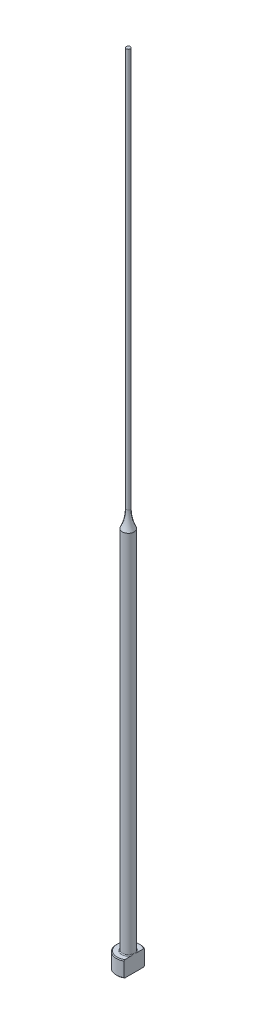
ISO-10303-21;
HEADER;
FILE_DESCRIPTION(('STEP AP214'),'2;1');
FILE_NAME('part.step','',(''),(''),'','','');
FILE_SCHEMA(('AUTOMOTIVE_DESIGN { 1 0 10303 214 1 1 1 1 }'));
ENDSEC;
DATA;
#1=APPLICATION_CONTEXT('core data for automotive mechanical design processes');
#2=APPLICATION_PROTOCOL_DEFINITION('international standard','automotive_design',2000,#1);
#3=PRODUCT_CONTEXT('',#1,'mechanical');
#4=PRODUCT('Part','Part','',(#3));
#5=PRODUCT_RELATED_PRODUCT_CATEGORY('part','',(#4));
#6=PRODUCT_DEFINITION_FORMATION('','',#4);
#7=PRODUCT_DEFINITION_CONTEXT('part definition',#1,'design');
#8=PRODUCT_DEFINITION('design','',#6,#7);
#9=PRODUCT_DEFINITION_SHAPE('','',#8);
#10=(LENGTH_UNIT() NAMED_UNIT(*) SI_UNIT(.MILLI.,.METRE.));
#11=(NAMED_UNIT(*) PLANE_ANGLE_UNIT() SI_UNIT($,.RADIAN.));
#12=(NAMED_UNIT(*) SI_UNIT($,.STERADIAN.) SOLID_ANGLE_UNIT());
#13=UNCERTAINTY_MEASURE_WITH_UNIT(LENGTH_MEASURE(1.E-05),#10,'distance_accuracy_value','');
#14=(GEOMETRIC_REPRESENTATION_CONTEXT(3) GLOBAL_UNCERTAINTY_ASSIGNED_CONTEXT((#13)) GLOBAL_UNIT_ASSIGNED_CONTEXT((#10,
#11,#12)) REPRESENTATION_CONTEXT('',''));
#15=CARTESIAN_POINT('',(0.,0.,0.));
#16=DIRECTION('',(0.,0.,1.));
#17=DIRECTION('',(1.,0.,0.));
#18=AXIS2_PLACEMENT_3D('',#15,#16,#17);
#19=CARTESIAN_POINT('',(-2.99999999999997,4.,0.));
#20=DIRECTION('',(0.,1.,0.));
#21=DIRECTION('',(0.,0.,1.));
#22=AXIS2_PLACEMENT_3D('',#19,#20,#21);
#23=PLANE('',#22);
#24=CARTESIAN_POINT('',(0.,4.,0.));
#25=DIRECTION('',(0.,1.,0.));
#26=DIRECTION('',(0.,0.,1.));
#27=AXIS2_PLACEMENT_3D('',#24,#25,#26);
#28=CIRCLE('',#27,2.79999999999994);
#29=CARTESIAN_POINT('',(1.49999999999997,4.,-2.36431808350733));
#30=VERTEX_POINT('',#29);
#31=CARTESIAN_POINT('',(1.49999999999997,4.,2.36431808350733));
#32=VERTEX_POINT('',#31);
#33=EDGE_CURVE('E187',#30,#32,#28,.T.);
#34=ORIENTED_EDGE('',*,*,#33,.T.);
#35=DIRECTION('',(0.,0.,-1.));
#36=VECTOR('',#35,1.);
#37=CARTESIAN_POINT('',(1.49999999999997,4.,0.));
#38=LINE('',#37,#36);
#39=CARTESIAN_POINT('',(1.49999999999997,3.99999999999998,0.799999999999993));
#40=VERTEX_POINT('',#39);
#41=EDGE_CURVE('E57',#32,#40,#38,.T.);
#42=ORIENTED_EDGE('',*,*,#41,.T.);
#43=CARTESIAN_POINT('',(0.,4.,0.));
#44=DIRECTION('',(0.,1.,0.));
#45=DIRECTION('',(0.,0.,1.));
#46=AXIS2_PLACEMENT_3D('',#43,#44,#45);
#47=CIRCLE('',#46,1.69999999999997);
#48=CARTESIAN_POINT('',(1.49999999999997,3.99999999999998,-0.799999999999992));
#49=VERTEX_POINT('',#48);
#50=EDGE_CURVE('E108',#40,#49,#47,.F.);
#51=ORIENTED_EDGE('',*,*,#50,.T.);
#52=EDGE_CURVE('E137',#49,#30,#38,.T.);
#53=ORIENTED_EDGE('',*,*,#52,.T.);
#54=EDGE_LOOP('',(#34,#42,#51,#53));
#55=FACE_BOUND('',#54,.T.);
#56=ADVANCED_FACE('F32',(#55),#23,.T.);
#57=CARTESIAN_POINT('',(0.,259.958771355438,0.));
#58=DIRECTION('',(0.,1.,0.));
#59=DIRECTION('',(0.,0.,1.));
#60=AXIS2_PLACEMENT_3D('',#57,#58,#59);
#61=CYLINDRICAL_SURFACE('',#60,2.99999999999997);
#62=CARTESIAN_POINT('',(0.,3.79999999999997,0.));
#63=DIRECTION('',(0.,1.,0.));
#64=DIRECTION('',(0.,0.,1.));
#65=AXIS2_PLACEMENT_3D('',#62,#63,#64);
#66=CIRCLE('',#65,2.99999999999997);
#67=CARTESIAN_POINT('',(1.49999999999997,3.79999999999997,2.5980762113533));
#68=VERTEX_POINT('',#67);
#69=CARTESIAN_POINT('',(1.49999999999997,3.79999999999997,-2.5980762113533));
#70=VERTEX_POINT('',#69);
#71=EDGE_CURVE('E105',#68,#70,#66,.F.);
#72=ORIENTED_EDGE('',*,*,#71,.T.);
#73=DIRECTION('',(0.,-1.,0.));
#74=VECTOR('',#73,1.);
#75=CARTESIAN_POINT('',(1.49999999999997,200.,-2.5980762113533));
#76=LINE('',#75,#74);
#77=CARTESIAN_POINT('',(1.49999999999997,0.200000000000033,-2.5980762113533));
#78=VERTEX_POINT('',#77);
#79=EDGE_CURVE('E193',#70,#78,#76,.T.);
#80=ORIENTED_EDGE('',*,*,#79,.T.);
#81=CARTESIAN_POINT('',(0.,0.200000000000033,0.));
#82=DIRECTION('',(0.,-1.,0.));
#83=DIRECTION('',(0.,0.,-1.));
#84=AXIS2_PLACEMENT_3D('',#81,#82,#83);
#85=CIRCLE('',#84,2.99999999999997);
#86=CARTESIAN_POINT('',(1.49999999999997,0.200000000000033,2.5980762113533));
#87=VERTEX_POINT('',#86);
#88=EDGE_CURVE('E100',#78,#87,#85,.F.);
#89=ORIENTED_EDGE('',*,*,#88,.T.);
#90=DIRECTION('',(0.,-1.,0.));
#91=VECTOR('',#90,1.);
#92=CARTESIAN_POINT('',(1.49999999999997,200.,2.5980762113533));
#93=LINE('',#92,#91);
#94=EDGE_CURVE('E93',#68,#87,#93,.T.);
#95=ORIENTED_EDGE('',*,*,#94,.F.);
#96=EDGE_LOOP('',(#72,#80,#89,#95));
#97=FACE_BOUND('',#96,.T.);
#98=ADVANCED_FACE('F158',(#97),#61,.T.);
#99=CARTESIAN_POINT('',(0.,0.,0.));
#100=DIRECTION('',(0.,-1.,0.));
#101=DIRECTION('',(0.,0.,-1.));
#102=AXIS2_PLACEMENT_3D('',#99,#100,#101);
#103=PLANE('',#102);
#104=CARTESIAN_POINT('',(0.,0.,0.));
#105=DIRECTION('',(0.,-1.,0.));
#106=DIRECTION('',(0.,0.,-1.));
#107=AXIS2_PLACEMENT_3D('',#104,#105,#106);
#108=CIRCLE('',#107,2.79999999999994);
#109=CARTESIAN_POINT('',(1.49999999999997,0.,2.36431808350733));
#110=VERTEX_POINT('',#109);
#111=CARTESIAN_POINT('',(1.49999999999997,0.,-2.36431808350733));
#112=VERTEX_POINT('',#111);
#113=EDGE_CURVE('E98',#110,#112,#108,.T.);
#114=ORIENTED_EDGE('',*,*,#113,.T.);
#115=DIRECTION('',(0.,0.,1.));
#116=VECTOR('',#115,1.);
#117=CARTESIAN_POINT('',(1.49999999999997,0.,2.5980762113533));
#118=LINE('',#117,#116);
#119=EDGE_CURVE('E83',#112,#110,#118,.T.);
#120=ORIENTED_EDGE('',*,*,#119,.T.);
#121=EDGE_LOOP('',(#114,#120));
#122=FACE_BOUND('',#121,.T.);
#123=ADVANCED_FACE('F103',(#122),#103,.T.);
#124=CARTESIAN_POINT('',(0.,4.,0.));
#125=DIRECTION('',(0.,-1.,0.));
#126=DIRECTION('',(0.,0.,-1.));
#127=AXIS2_PLACEMENT_3D('',#124,#125,#126);
#128=CONICAL_SURFACE('',#127,2.79999999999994,0.785398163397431);
#129=ORIENTED_EDGE('',*,*,#71,.F.);
#130=CARTESIAN_POINT('',(1.49999999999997,0.888258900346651,5.71827621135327));
#131=CARTESIAN_POINT('',(1.49999999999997,1.01361833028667,5.58866816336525));
#132=CARTESIAN_POINT('',(1.49999999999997,1.13884324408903,5.45892957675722));
#133=CARTESIAN_POINT('',(1.49999999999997,1.38894444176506,5.19911365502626));
#134=CARTESIAN_POINT('',(1.49999999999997,1.51382072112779,5.06903631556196));
#135=CARTESIAN_POINT('',(1.49999999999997,1.76320568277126,4.80840180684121));
#136=CARTESIAN_POINT('',(1.49999999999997,1.88771414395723,4.67784442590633));
#137=CARTESIAN_POINT('',(1.49999999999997,2.13618059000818,4.4162081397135));
#138=CARTESIAN_POINT('',(1.49999999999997,2.26013857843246,4.28512923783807));
#139=CARTESIAN_POINT('',(1.49999999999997,2.50488975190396,4.02490837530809));
#140=CARTESIAN_POINT('',(1.49999999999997,2.62569693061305,3.8957795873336));
#141=CARTESIAN_POINT('',(1.49999999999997,2.86640694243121,3.63668213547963));
#142=CARTESIAN_POINT('',(1.49999999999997,2.98630978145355,3.50671347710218));
#143=CARTESIAN_POINT('',(1.49999999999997,3.22486033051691,3.24567921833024));
#144=CARTESIAN_POINT('',(1.49999999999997,3.3435083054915,3.11461386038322));
#145=CARTESIAN_POINT('',(1.49999999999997,3.5790771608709,2.85094268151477));
#146=CARTESIAN_POINT('',(1.49999999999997,3.69599811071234,2.71833692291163));
#147=CARTESIAN_POINT('',(1.49999999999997,3.88262371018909,2.50255231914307));
#148=CARTESIAN_POINT('',(1.49999999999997,3.95312454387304,2.42006293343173));
#149=CARTESIAN_POINT('',(1.49999999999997,4.09287098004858,2.254010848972));
#150=CARTESIAN_POINT('',(1.49999999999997,4.16211645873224,2.17044804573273));
#151=CARTESIAN_POINT('',(1.49999999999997,4.29964684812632,2.00105967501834));
#152=CARTESIAN_POINT('',(1.49999999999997,4.36791386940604,1.9152195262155));
#153=CARTESIAN_POINT('',(1.49999999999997,4.50205840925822,1.7417139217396));
#154=CARTESIAN_POINT('',(1.49999999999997,4.56793649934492,1.65404891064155));
#155=CARTESIAN_POINT('',(1.49999999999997,4.69728151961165,1.47490236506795));
#156=CARTESIAN_POINT('',(1.49999999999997,4.76069661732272,1.38338308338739));
#157=CARTESIAN_POINT('',(1.49999999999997,4.88239539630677,1.19675661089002));
#158=CARTESIAN_POINT('',(1.49999999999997,4.94067201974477,1.10164473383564));
#159=CARTESIAN_POINT('',(1.49999999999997,5.048413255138,0.908008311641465));
#160=CARTESIAN_POINT('',(1.49999999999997,5.09797809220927,0.809540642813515));
#161=CARTESIAN_POINT('',(1.49999999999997,5.18432188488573,0.607192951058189));
#162=CARTESIAN_POINT('',(1.49999999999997,5.22114374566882,0.50333247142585));
#163=CARTESIAN_POINT('',(1.49999999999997,5.26099935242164,0.347577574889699));
#164=CARTESIAN_POINT('',(1.49999999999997,5.2715702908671,0.297609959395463));
#165=CARTESIAN_POINT('',(1.49999999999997,5.28794860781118,0.196885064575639));
#166=CARTESIAN_POINT('',(1.49999999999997,5.29375640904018,0.146127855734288));
#167=CARTESIAN_POINT('',(1.49999999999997,5.30019707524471,0.0444388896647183));
#168=CARTESIAN_POINT('',(1.49999999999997,5.30084594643,-0.00649183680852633));
#169=CARTESIAN_POINT('',(1.49999999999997,5.29696416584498,-0.108155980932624));
#170=CARTESIAN_POINT('',(1.49999999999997,5.29243308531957,-0.158889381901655));
#171=CARTESIAN_POINT('',(1.49999999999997,5.27856915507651,-0.259234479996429));
#172=CARTESIAN_POINT('',(1.49999999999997,5.2692782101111,-0.308852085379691));
#173=CARTESIAN_POINT('',(1.49999999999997,5.24647108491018,-0.407110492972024));
#174=CARTESIAN_POINT('',(1.49999999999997,5.23295324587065,-0.45575090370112));
#175=CARTESIAN_POINT('',(1.49999999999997,5.20226175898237,-0.55214996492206));
#176=CARTESIAN_POINT('',(1.49999999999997,5.18506801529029,-0.599902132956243));
#177=CARTESIAN_POINT('',(1.49999999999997,5.1477138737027,-0.694205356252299));
#178=CARTESIAN_POINT('',(1.49999999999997,5.12755408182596,-0.740756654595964));
#179=CARTESIAN_POINT('',(1.49999999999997,5.0632769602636,-0.879166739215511));
#180=CARTESIAN_POINT('',(1.49999999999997,5.01551721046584,-0.969329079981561));
#181=CARTESIAN_POINT('',(1.49999999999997,4.91367909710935,-1.14604316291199));
#182=CARTESIAN_POINT('',(1.49999999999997,4.85959300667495,-1.2325903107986));
#183=CARTESIAN_POINT('',(1.49999999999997,4.74697968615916,-1.40321348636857));
#184=CARTESIAN_POINT('',(1.49999999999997,4.68843573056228,-1.4872783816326));
#185=CARTESIAN_POINT('',(1.49999999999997,4.5684384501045,-1.65322187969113));
#186=CARTESIAN_POINT('',(1.49999999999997,4.50698656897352,-1.73510153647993));
#187=CARTESIAN_POINT('',(1.49999999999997,4.3811567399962,-1.89829823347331));
#188=CARTESIAN_POINT('',(1.49999999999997,4.31675092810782,-1.97959369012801));
#189=CARTESIAN_POINT('',(1.49999999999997,4.18634068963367,-2.14090082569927));
#190=CARTESIAN_POINT('',(1.49999999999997,4.12033609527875,-2.22091236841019));
#191=CARTESIAN_POINT('',(1.49999999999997,3.92086431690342,-2.45906508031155));
#192=CARTESIAN_POINT('',(1.49999999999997,3.78562663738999,-2.61572090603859));
#193=CARTESIAN_POINT('',(1.49999999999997,3.53554498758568,-2.90006295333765));
#194=CARTESIAN_POINT('',(1.49999999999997,3.42114543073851,-3.02814382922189));
#195=CARTESIAN_POINT('',(1.49999999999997,3.1909355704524,-3.28303767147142));
#196=CARTESIAN_POINT('',(1.49999999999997,3.07512522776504,-3.40985060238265));
#197=CARTESIAN_POINT('',(1.49999999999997,2.72597067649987,-3.78913849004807));
#198=CARTESIAN_POINT('',(1.49999999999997,2.49111760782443,-4.04022177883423));
#199=CARTESIAN_POINT('',(1.49999999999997,2.0288247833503,-4.52992803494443));
#200=CARTESIAN_POINT('',(1.49999999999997,1.80147747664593,-4.7686387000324));
#201=CARTESIAN_POINT('',(1.49999999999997,1.45954865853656,-5.12558036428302));
#202=CARTESIAN_POINT('',(1.49999999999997,1.34548484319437,-5.24430773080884));
#203=CARTESIAN_POINT('',(1.49999999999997,1.11707176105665,-5.48148573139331));
#204=CARTESIAN_POINT('',(1.49999999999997,1.00272249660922,-5.59993636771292));
#205=CARTESIAN_POINT('',(1.49999999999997,0.888258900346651,-5.71827621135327));
#206=B_SPLINE_CURVE_WITH_KNOTS('',3,(#130,#131,#132,#133,#134,#135,#136,#137,#138,#139,#140,
#141,#142,#143,#144,#145,#146,#147,#148,#149,#150,#151,#152,#153,#154,#155,#156,#157,#158,#159,
#160,#161,#162,#163,#164,#165,#166,#167,#168,#169,#170,#171,#172,#173,#174,#175,#176,#177,#178,
#179,#180,#181,#182,#183,#184,#185,#186,#187,#188,#189,#190,#191,#192,#193,#194,#195,#196,#197,
#198,#199,#200,#201,#202,#203,#204,#205),.UNSPECIFIED.,.F.,.F.,(4,2,2,2,2,2,2,2,2,2,2,2,2,2,2,2,
2,2,2,2,2,2,2,2,2,2,2,2,2,2,2,2,2,2,2,2,2,4),(0.,0.540943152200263,1.08189327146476,
1.62312052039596,2.16434426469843,2.69482920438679,3.22531067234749,3.75567781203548,
4.28602356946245,4.611550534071,4.9371094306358,5.26610945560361,5.59503024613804,
5.92894782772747,6.26331713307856,6.59354403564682,6.92264800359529,7.07567478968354,
7.22868799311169,7.38122626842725,7.53377717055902,7.68500755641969,7.83629736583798,
7.988436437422,8.14054446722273,8.44618799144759,8.75220879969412,9.05944044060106,
9.36652111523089,9.6776428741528,9.98879742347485,10.609592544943,11.1247803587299,
11.6399825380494,12.6713544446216,13.6603005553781,14.1542238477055,14.6481430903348),.UNSPECIFIED.);
#207=EDGE_CURVE('E136',#68,#32,#206,.T.);
#208=ORIENTED_EDGE('',*,*,#207,.T.);
#209=ORIENTED_EDGE('',*,*,#33,.F.);
#210=EDGE_CURVE('E128',#30,#70,#206,.T.);
#211=ORIENTED_EDGE('',*,*,#210,.T.);
#212=EDGE_LOOP('',(#129,#208,#209,#211));
#213=FACE_BOUND('',#212,.T.);
#214=ADVANCED_FACE('F144',(#213),#128,.T.);
#215=CARTESIAN_POINT('',(0.,0.200000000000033,0.));
#216=DIRECTION('',(0.,1.,0.));
#217=DIRECTION('',(0.,0.,1.));
#218=AXIS2_PLACEMENT_3D('',#215,#216,#217);
#219=CONICAL_SURFACE('',#218,2.99999999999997,0.785398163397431);
#220=ORIENTED_EDGE('',*,*,#88,.F.);
#221=CARTESIAN_POINT('',(1.49999999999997,3.11174109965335,-5.71827621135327));
#222=CARTESIAN_POINT('',(1.49999999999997,2.98638166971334,-5.58866816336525));
#223=CARTESIAN_POINT('',(1.49999999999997,2.86115675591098,-5.45892957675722));
#224=CARTESIAN_POINT('',(1.49999999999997,2.61105555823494,-5.19911365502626));
#225=CARTESIAN_POINT('',(1.49999999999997,2.48617927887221,-5.06903631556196));
#226=CARTESIAN_POINT('',(1.49999999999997,2.23679431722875,-4.80840180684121));
#227=CARTESIAN_POINT('',(1.49999999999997,2.11228585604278,-4.67784442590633));
#228=CARTESIAN_POINT('',(1.49999999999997,1.86381940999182,-4.4162081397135));
#229=CARTESIAN_POINT('',(1.49999999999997,1.73986142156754,-4.28512923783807));
#230=CARTESIAN_POINT('',(1.49999999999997,1.49511024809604,-4.02490837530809));
#231=CARTESIAN_POINT('',(1.49999999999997,1.37430306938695,-3.8957795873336));
#232=CARTESIAN_POINT('',(1.49999999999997,1.13359305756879,-3.63668213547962));
#233=CARTESIAN_POINT('',(1.49999999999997,1.01369021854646,-3.50671347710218));
#234=CARTESIAN_POINT('',(1.49999999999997,0.775139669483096,-3.24567921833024));
#235=CARTESIAN_POINT('',(1.49999999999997,0.656491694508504,-3.11461386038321));
#236=CARTESIAN_POINT('',(1.49999999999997,0.420922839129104,-2.85094268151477));
#237=CARTESIAN_POINT('',(1.49999999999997,0.304001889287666,-2.71833692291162));
#238=CARTESIAN_POINT('',(1.49999999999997,0.117376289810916,-2.50255231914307));
#239=CARTESIAN_POINT('',(1.49999999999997,0.0468754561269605,-2.42006293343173));
#240=CARTESIAN_POINT('',(1.49999999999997,-0.0928709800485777,-2.254010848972));
#241=CARTESIAN_POINT('',(1.49999999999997,-0.162116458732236,-2.17044804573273));
#242=CARTESIAN_POINT('',(1.49999999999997,-0.299646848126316,-2.00105967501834));
#243=CARTESIAN_POINT('',(1.49999999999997,-0.367913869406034,-1.9152195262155));
#244=CARTESIAN_POINT('',(1.49999999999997,-0.502058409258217,-1.7417139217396));
#245=CARTESIAN_POINT('',(1.49999999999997,-0.567936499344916,-1.65404891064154));
#246=CARTESIAN_POINT('',(1.49999999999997,-0.697281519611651,-1.47490236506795));
#247=CARTESIAN_POINT('',(1.49999999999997,-0.760696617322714,-1.38338308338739));
#248=CARTESIAN_POINT('',(1.49999999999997,-0.882395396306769,-1.19675661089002));
#249=CARTESIAN_POINT('',(1.49999999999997,-0.940672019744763,-1.10164473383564));
#250=CARTESIAN_POINT('',(1.49999999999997,-1.048413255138,-0.908008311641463));
#251=CARTESIAN_POINT('',(1.49999999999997,-1.09797809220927,-0.809540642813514));
#252=CARTESIAN_POINT('',(1.49999999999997,-1.18432188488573,-0.607192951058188));
#253=CARTESIAN_POINT('',(1.49999999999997,-1.22114374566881,-0.503332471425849));
#254=CARTESIAN_POINT('',(1.49999999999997,-1.26099935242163,-0.347577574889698));
#255=CARTESIAN_POINT('',(1.49999999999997,-1.2715702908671,-0.297609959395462));
#256=CARTESIAN_POINT('',(1.49999999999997,-1.28794860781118,-0.196885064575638));
#257=CARTESIAN_POINT('',(1.49999999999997,-1.29375640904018,-0.146127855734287));
#258=CARTESIAN_POINT('',(1.49999999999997,-1.30019707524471,-0.0444388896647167));
#259=CARTESIAN_POINT('',(1.49999999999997,-1.30084594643,0.00649183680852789));
#260=CARTESIAN_POINT('',(1.49999999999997,-1.29696416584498,0.108155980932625));
#261=CARTESIAN_POINT('',(1.49999999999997,-1.29243308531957,0.158889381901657));
#262=CARTESIAN_POINT('',(1.49999999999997,-1.2785691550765,0.259234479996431));
#263=CARTESIAN_POINT('',(1.49999999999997,-1.2692782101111,0.308852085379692));
#264=CARTESIAN_POINT('',(1.49999999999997,-1.24647108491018,0.407110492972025));
#265=CARTESIAN_POINT('',(1.49999999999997,-1.23295324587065,0.455750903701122));
#266=CARTESIAN_POINT('',(1.49999999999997,-1.20226175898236,0.552149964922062));
#267=CARTESIAN_POINT('',(1.49999999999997,-1.18506801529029,0.599902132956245));
#268=CARTESIAN_POINT('',(1.49999999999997,-1.14771387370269,0.694205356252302));
#269=CARTESIAN_POINT('',(1.49999999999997,-1.12755408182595,0.740756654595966));
#270=CARTESIAN_POINT('',(1.49999999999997,-1.0632769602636,0.879166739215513));
#271=CARTESIAN_POINT('',(1.49999999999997,-1.01551721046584,0.969329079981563));
#272=CARTESIAN_POINT('',(1.49999999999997,-0.913679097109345,1.14604316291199));
#273=CARTESIAN_POINT('',(1.49999999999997,-0.859593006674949,1.2325903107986));
#274=CARTESIAN_POINT('',(1.49999999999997,-0.746979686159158,1.40321348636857));
#275=CARTESIAN_POINT('',(1.49999999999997,-0.688435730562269,1.4872783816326));
#276=CARTESIAN_POINT('',(1.49999999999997,-0.568438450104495,1.65322187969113));
#277=CARTESIAN_POINT('',(1.49999999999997,-0.506986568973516,1.73510153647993));
#278=CARTESIAN_POINT('',(1.49999999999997,-0.381156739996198,1.89829823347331));
#279=CARTESIAN_POINT('',(1.49999999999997,-0.316750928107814,1.97959369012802));
#280=CARTESIAN_POINT('',(1.49999999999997,-0.186340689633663,2.14090082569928));
#281=CARTESIAN_POINT('',(1.49999999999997,-0.12033609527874,2.22091236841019));
#282=CARTESIAN_POINT('',(1.49999999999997,0.0791356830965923,2.45906508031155));
#283=CARTESIAN_POINT('',(1.49999999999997,0.214373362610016,2.61572090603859));
#284=CARTESIAN_POINT('',(1.49999999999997,0.46445501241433,2.90006295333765));
#285=CARTESIAN_POINT('',(1.49999999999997,0.578854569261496,3.02814382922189));
#286=CARTESIAN_POINT('',(1.49999999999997,0.809064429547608,3.28303767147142));
#287=CARTESIAN_POINT('',(1.49999999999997,0.924874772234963,3.40985060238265));
#288=CARTESIAN_POINT('',(1.49999999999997,1.27402932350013,3.78913849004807));
#289=CARTESIAN_POINT('',(1.49999999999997,1.50888239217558,4.04022177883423));
#290=CARTESIAN_POINT('',(1.49999999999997,1.97117521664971,4.52992803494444));
#291=CARTESIAN_POINT('',(1.49999999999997,2.19852252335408,4.76863870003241));
#292=CARTESIAN_POINT('',(1.49999999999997,2.54045134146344,5.12558036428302));
#293=CARTESIAN_POINT('',(1.49999999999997,2.65451515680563,5.24430773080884));
#294=CARTESIAN_POINT('',(1.49999999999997,2.88292823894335,5.48148573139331));
#295=CARTESIAN_POINT('',(1.49999999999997,2.99727750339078,5.59993636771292));
#296=CARTESIAN_POINT('',(1.49999999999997,3.11174109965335,5.71827621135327));
#297=B_SPLINE_CURVE_WITH_KNOTS('',3,(#221,#222,#223,#224,#225,#226,#227,#228,#229,#230,#231,
#232,#233,#234,#235,#236,#237,#238,#239,#240,#241,#242,#243,#244,#245,#246,#247,#248,#249,#250,
#251,#252,#253,#254,#255,#256,#257,#258,#259,#260,#261,#262,#263,#264,#265,#266,#267,#268,#269,
#270,#271,#272,#273,#274,#275,#276,#277,#278,#279,#280,#281,#282,#283,#284,#285,#286,#287,#288,
#289,#290,#291,#292,#293,#294,#295,#296),.UNSPECIFIED.,.F.,.F.,(4,2,2,2,2,2,2,2,2,2,2,2,2,2,2,2,
2,2,2,2,2,2,2,2,2,2,2,2,2,2,2,2,2,2,2,2,2,4),(0.,0.540943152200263,1.08189327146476,
1.62312052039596,2.16434426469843,2.69482920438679,3.22531067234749,3.75567781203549,
4.28602356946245,4.611550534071,4.9371094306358,5.26610945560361,5.59503024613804,
5.92894782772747,6.26331713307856,6.59354403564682,6.92264800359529,7.07567478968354,
7.2286879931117,7.38122626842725,7.53377717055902,7.6850075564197,7.83629736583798,
7.98843643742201,8.14054446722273,8.44618799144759,8.75220879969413,9.05944044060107,
9.3665211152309,9.6776428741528,9.98879742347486,10.609592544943,11.1247803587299,
11.6399825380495,12.6713544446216,13.6603005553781,14.1542238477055,14.6481430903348),.UNSPECIFIED.);
#298=EDGE_CURVE('E86',#78,#112,#297,.T.);
#299=ORIENTED_EDGE('',*,*,#298,.T.);
#300=ORIENTED_EDGE('',*,*,#113,.F.);
#301=EDGE_CURVE('E89',#110,#87,#297,.T.);
#302=ORIENTED_EDGE('',*,*,#301,.T.);
#303=EDGE_LOOP('',(#220,#299,#300,#302));
#304=FACE_BOUND('',#303,.T.);
#305=ADVANCED_FACE('F97',(#304),#219,.T.);
#306=CARTESIAN_POINT('',(0.,4.19999999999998,0.));
#307=DIRECTION('',(0.,1.,0.));
#308=DIRECTION('',(0.,0.,1.));
#309=AXIS2_PLACEMENT_3D('',#306,#307,#308);
#310=TOROIDAL_SURFACE('',#309,1.69999999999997,0.2);
#311=CARTESIAN_POINT('',(1.49999999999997,4.19999999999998,0.));
#312=CARTESIAN_POINT('',(1.49999999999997,4.20000050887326,7.14686674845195E-11));
#313=CARTESIAN_POINT('',(1.49999999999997,4.20000101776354,-1.21663673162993E-07));
#314=CARTESIAN_POINT('',(1.49999999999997,4.20000199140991,-4.97616237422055E-07));
#315=CARTESIAN_POINT('',(1.49999999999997,4.20000245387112,-7.56516220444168E-07));
#316=CARTESIAN_POINT('',(1.49999999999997,4.20000338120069,-1.37642837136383E-06));
#317=CARTESIAN_POINT('',(1.49999999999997,4.20000384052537,-1.74563476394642E-06));
#318=CARTESIAN_POINT('',(1.49999999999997,4.20000469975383,-2.53565984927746E-06));
#319=CARTESIAN_POINT('',(1.49999999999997,4.20000510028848,-2.95582597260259E-06));
#320=CARTESIAN_POINT('',(1.49999999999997,4.20000646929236,-4.48430445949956E-06));
#321=CARTESIAN_POINT('',(1.49999999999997,4.20000736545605,-5.6586103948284E-06));
#322=CARTESIAN_POINT('',(1.49999999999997,4.20000893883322,-8.06479202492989E-06));
#323=CARTESIAN_POINT('',(1.49999999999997,4.20000962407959,-9.29170517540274E-06));
#324=CARTESIAN_POINT('',(1.49999999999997,4.20001225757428,-1.416232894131E-05));
#325=CARTESIAN_POINT('',(1.49999999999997,4.20001407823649,-1.78790031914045E-05));
#326=CARTESIAN_POINT('',(1.49999999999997,4.20001699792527,-2.51443066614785E-05));
#327=CARTESIAN_POINT('',(1.49999999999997,4.20001815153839,-2.86715394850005E-05));
#328=CARTESIAN_POINT('',(1.49999999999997,4.20002315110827,-4.39218128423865E-05));
#329=CARTESIAN_POINT('',(1.49999999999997,4.20002701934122,-5.56288390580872E-05));
#330=CARTESIAN_POINT('',(1.49999999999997,4.20003312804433,-7.7405829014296E-05));
#331=CARTESIAN_POINT('',(1.49999999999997,4.20003553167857,-8.74278412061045E-05));
#332=CARTESIAN_POINT('',(1.49999999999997,4.20005483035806,-0.000161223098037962));
#333=CARTESIAN_POINT('',(1.49999999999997,4.20007979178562,-0.000222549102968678));
#334=CARTESIAN_POINT('',(1.49999999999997,4.20017391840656,-0.000462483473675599));
#335=CARTESIAN_POINT('',(1.49999999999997,4.20023706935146,-0.000642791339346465));
#336=CARTESIAN_POINT('',(1.49999999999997,4.20048761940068,-0.00134785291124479));
#337=CARTESIAN_POINT('',(1.49999999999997,4.20068132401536,-0.00187087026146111));
#338=CARTESIAN_POINT('',(1.49999999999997,4.20147357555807,-0.00402004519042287));
#339=CARTESIAN_POINT('',(1.49999999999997,4.20206499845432,-0.0056481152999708));
#340=CARTESIAN_POINT('',(1.49999999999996,4.20892634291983,-0.0245232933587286));
#341=CARTESIAN_POINT('',(1.49999999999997,4.21523683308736,-0.041759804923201));
#342=CARTESIAN_POINT('',(1.49999999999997,4.22755028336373,-0.0756091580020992));
#343=CARTESIAN_POINT('',(1.49999999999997,4.23355589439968,-0.0922211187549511));
#344=CARTESIAN_POINT('',(1.49999999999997,4.24620101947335,-0.127454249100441));
#345=CARTESIAN_POINT('',(1.49999999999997,4.25283080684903,-0.146078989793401));
#346=CARTESIAN_POINT('',(1.49999999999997,4.26599765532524,-0.183577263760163));
#347=CARTESIAN_POINT('',(1.49999999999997,4.27253305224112,-0.202451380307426));
#348=CARTESIAN_POINT('',(1.49999999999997,4.28834228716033,-0.248982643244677));
#349=CARTESIAN_POINT('',(1.49999999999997,4.2974915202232,-0.276682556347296));
#350=CARTESIAN_POINT('',(1.49999999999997,4.31490935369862,-0.331625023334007));
#351=CARTESIAN_POINT('',(1.49999999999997,4.3231938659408,-0.358862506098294));
#352=CARTESIAN_POINT('',(1.49999999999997,4.34051594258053,-0.419125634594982));
#353=CARTESIAN_POINT('',(1.49999999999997,4.34936607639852,-0.452206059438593));
#354=CARTESIAN_POINT('',(1.49999999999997,4.36549583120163,-0.519023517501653));
#355=CARTESIAN_POINT('',(1.49999999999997,4.37276283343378,-0.552763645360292));
#356=CARTESIAN_POINT('',(1.49999999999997,4.38554755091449,-0.62305310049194));
#357=CARTESIAN_POINT('',(1.49999999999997,4.39090573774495,-0.65963271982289));
#358=CARTESIAN_POINT('',(1.49999999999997,4.39825016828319,-0.733028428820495));
#359=CARTESIAN_POINT('',(1.49999999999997,4.40024734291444,-0.76984335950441));
#360=CARTESIAN_POINT('',(1.49999999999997,4.39970780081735,-0.842856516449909));
#361=CARTESIAN_POINT('',(1.49999999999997,4.39725347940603,-0.879053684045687));
#362=CARTESIAN_POINT('',(1.49999999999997,4.38900085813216,-0.93238076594));
#363=CARTESIAN_POINT('',(1.49999999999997,4.38553049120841,-0.949868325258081));
#364=CARTESIAN_POINT('',(1.49999999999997,4.37678336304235,-0.984374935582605));
#365=CARTESIAN_POINT('',(1.49999999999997,4.37150943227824,-1.00139467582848));
#366=CARTESIAN_POINT('',(1.49999999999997,4.35869781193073,-1.03479423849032));
#367=CARTESIAN_POINT('',(1.49999999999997,4.3511359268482,-1.05116499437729));
#368=CARTESIAN_POINT('',(1.49999999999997,4.33325333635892,-1.08234828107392));
#369=CARTESIAN_POINT('',(1.49999999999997,4.32294266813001,-1.09716621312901));
#370=CARTESIAN_POINT('',(1.49999999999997,4.30512758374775,-1.11714173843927));
#371=CARTESIAN_POINT('',(1.49999999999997,4.29884721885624,-1.12339066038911));
#372=CARTESIAN_POINT('',(1.49999999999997,4.28545950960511,-1.13494695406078));
#373=CARTESIAN_POINT('',(1.49999999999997,4.27835226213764,-1.14025443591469));
#374=CARTESIAN_POINT('',(1.49999999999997,4.26325970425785,-1.14967631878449));
#375=CARTESIAN_POINT('',(1.49999999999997,4.25526534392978,-1.15377649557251));
#376=CARTESIAN_POINT('',(1.49999999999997,4.23863207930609,-1.16034952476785));
#377=CARTESIAN_POINT('',(1.49999999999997,4.22999427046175,-1.16282507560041));
#378=CARTESIAN_POINT('',(1.49999999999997,4.21343922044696,-1.16570267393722));
#379=CARTESIAN_POINT('',(1.49999999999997,4.20555896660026,-1.16631687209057));
#380=CARTESIAN_POINT('',(1.49999999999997,4.18982775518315,-1.16602054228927));
#381=CARTESIAN_POINT('',(1.49999999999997,4.18197679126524,-1.16511036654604));
#382=CARTESIAN_POINT('',(1.49999999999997,4.16747846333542,-1.16204446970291));
#383=CARTESIAN_POINT('',(1.49999999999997,4.16079696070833,-1.16004509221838));
#384=CARTESIAN_POINT('',(1.49999999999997,4.14781700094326,-1.15505972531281));
#385=CARTESIAN_POINT('',(1.49999999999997,4.14151862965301,-1.1520735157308));
#386=CARTESIAN_POINT('',(1.49999999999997,4.12690214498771,-1.14387585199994));
#387=CARTESIAN_POINT('',(1.49999999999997,4.11881436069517,-1.13825400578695));
#388=CARTESIAN_POINT('',(1.49999999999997,4.1036444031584,-1.12578441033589));
#389=CARTESIAN_POINT('',(1.49999999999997,4.09656475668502,-1.11893367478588));
#390=CARTESIAN_POINT('',(1.49999999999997,4.08012297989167,-1.10074342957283));
#391=CARTESIAN_POINT('',(1.49999999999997,4.07136543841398,-1.08886044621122));
#392=CARTESIAN_POINT('',(1.49999999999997,4.05578194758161,-1.06392743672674));
#393=CARTESIAN_POINT('',(1.49999999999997,4.0489571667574,-1.05087671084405));
#394=CARTESIAN_POINT('',(1.49999999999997,4.03273856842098,-1.01472307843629));
#395=CARTESIAN_POINT('',(1.49999999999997,4.02486230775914,-0.990945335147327));
#396=CARTESIAN_POINT('',(1.49999999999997,4.01257693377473,-0.94232199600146));
#397=CARTESIAN_POINT('',(1.49999999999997,4.00820590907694,-0.917467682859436));
#398=CARTESIAN_POINT('',(1.49999999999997,4.00229956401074,-0.867912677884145));
#399=CARTESIAN_POINT('',(1.49999999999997,4.0007128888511,-0.843217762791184));
#400=CARTESIAN_POINT('',(1.49999999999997,3.9996723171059,-0.79374605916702));
#401=CARTESIAN_POINT('',(1.49999999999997,4.0002230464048,-0.768969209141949));
#402=CARTESIAN_POINT('',(1.49999999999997,4.00433101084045,-0.696994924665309));
#403=CARTESIAN_POINT('',(1.49999999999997,4.01016976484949,-0.64993124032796));
#404=CARTESIAN_POINT('',(1.49999999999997,4.02567776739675,-0.559166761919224));
#405=CARTESIAN_POINT('',(1.49999999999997,4.03511950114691,-0.515423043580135));
#406=CARTESIAN_POINT('',(1.49999999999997,4.05693059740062,-0.427590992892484));
#407=CARTESIAN_POINT('',(1.49999999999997,4.06936356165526,-0.383518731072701));
#408=CARTESIAN_POINT('',(1.49999999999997,4.09174953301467,-0.310161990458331));
#409=CARTESIAN_POINT('',(1.49999999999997,4.10119843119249,-0.280718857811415));
#410=CARTESIAN_POINT('',(1.49999999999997,4.12060442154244,-0.22234098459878));
#411=CARTESIAN_POINT('',(1.49999999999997,4.13055519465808,-0.193404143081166));
#412=CARTESIAN_POINT('',(1.49999999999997,4.14973721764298,-0.138756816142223));
#413=CARTESIAN_POINT('',(1.49999999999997,4.15893123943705,-0.113033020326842));
#414=CARTESIAN_POINT('',(1.49999999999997,4.17788037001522,-0.0606351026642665));
#415=CARTESIAN_POINT('',(1.49999999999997,4.18764328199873,-0.0339636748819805));
#416=CARTESIAN_POINT('',(1.49999999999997,4.19793548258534,-0.00564657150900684));
#417=CARTESIAN_POINT('',(1.49999999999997,4.19852751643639,-0.00401699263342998));
#418=CARTESIAN_POINT('',(1.49999999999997,4.1993199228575,-0.0018674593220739));
#419=CARTESIAN_POINT('',(1.49999999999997,4.19951319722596,-0.00134559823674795));
#420=CARTESIAN_POINT('',(1.49999999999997,4.19976322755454,-0.000641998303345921));
#421=CARTESIAN_POINT('',(1.49999999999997,4.19982627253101,-0.000461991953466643));
#422=CARTESIAN_POINT('',(1.49999999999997,4.19992025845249,-0.000222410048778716));
#423=CARTESIAN_POINT('',(1.49999999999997,4.19994519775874,-0.000161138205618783));
#424=CARTESIAN_POINT('',(1.49999999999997,4.19996448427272,-8.74039267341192E-05));
#425=CARTESIAN_POINT('',(1.49999999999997,4.19996688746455,-7.73857556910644E-05));
#426=CARTESIAN_POINT('',(1.49999999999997,4.1999729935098,-5.56173272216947E-05));
#427=CARTESIAN_POINT('',(1.49999999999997,4.19997685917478,-4.39149186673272E-05));
#428=CARTESIAN_POINT('',(1.49999999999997,4.19998185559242,-2.86698156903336E-05));
#429=CARTESIAN_POINT('',(1.49999999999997,4.19998300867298,-2.51431575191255E-05));
#430=CARTESIAN_POINT('',(1.49999999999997,4.19998592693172,-1.78789552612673E-05));
#431=CARTESIAN_POINT('',(1.49999999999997,4.19998774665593,-1.41627846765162E-05));
#432=CARTESIAN_POINT('',(1.49999999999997,4.19999037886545,-9.29264488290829E-06));
#433=CARTESIAN_POINT('',(1.49999999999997,4.19999106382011,-8.06577599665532E-06));
#434=CARTESIAN_POINT('',(1.49999999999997,4.19999263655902,-5.65962639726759E-06));
#435=CARTESIAN_POINT('',(1.49999999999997,4.19999353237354,-4.48530466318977E-06));
#436=CARTESIAN_POINT('',(1.49999999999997,4.19999490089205,-2.95673740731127E-06));
#437=CARTESIAN_POINT('',(1.49999999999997,4.1999953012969,-2.53653208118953E-06));
#438=CARTESIAN_POINT('',(1.49999999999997,4.19999616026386,-1.74640525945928E-06));
#439=CARTESIAN_POINT('',(1.49999999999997,4.19999661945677,-1.37713598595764E-06));
#440=CARTESIAN_POINT('',(1.49999999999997,4.19999754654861,-7.57072336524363E-07));
#441=CARTESIAN_POINT('',(1.49999999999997,4.19999800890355,-4.9808738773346E-07));
#442=CARTESIAN_POINT('',(1.49999999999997,4.19999898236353,-1.21927249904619E-07));
#443=CARTESIAN_POINT('',(1.49999999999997,4.19999949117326,-7.14621294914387E-11));
#444=CARTESIAN_POINT('',(1.49999999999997,4.19999999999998,0.));
#445=B_SPLINE_CURVE_WITH_KNOTS('',3,(#311,#312,#313,#314,#315,#316,#317,#318,#319,#320,#321,
#322,#323,#324,#325,#326,#327,#328,#329,#330,#331,#332,#333,#334,#335,#336,#337,#338,#339,#340,
#341,#342,#343,#344,#345,#346,#347,#348,#349,#350,#351,#352,#353,#354,#355,#356,#357,#358,#359,
#360,#361,#362,#363,#364,#365,#366,#367,#368,#369,#370,#371,#372,#373,#374,#375,#376,#377,#378,
#379,#380,#381,#382,#383,#384,#385,#386,#387,#388,#389,#390,#391,#392,#393,#394,#395,#396,#397,
#398,#399,#400,#401,#402,#403,#404,#405,#406,#407,#408,#409,#410,#411,#412,#413,#414,#415,#416,
#417,#418,#419,#420,#421,#422,#423,#424,#425,#426,#427,#428,#429,#430,#431,#432,#433,#434,#435,
#436,#437,#438,#439,#440,#441,#442,#443,#444),.UNSPECIFIED.,.T.,.F.,(4,2,2,2,2,2,2,2,2,2,2,2,2,
2,2,2,2,2,2,2,2,2,2,2,2,2,2,2,2,2,2,2,2,2,2,2,2,2,2,2,2,2,2,2,2,2,2,2,2,2,2,2,2,2,2,2,2,2,2,2,2,
2,2,2,2,2,4),(0.,1.5268750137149E-06,3.10959387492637E-06,4.86976756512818E-06,
6.60940084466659E-06,1.10202525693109E-05,1.5232779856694E-05,2.7614037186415E-05,
3.87351645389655E-05,7.57188332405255E-05,0.000106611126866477,0.000304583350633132,
0.00087827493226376,0.00255078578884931,0.0077480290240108,0.0628090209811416,0.115802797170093,
0.175110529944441,0.23503061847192,0.32253950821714,0.407938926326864,0.510638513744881,
0.614128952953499,0.724918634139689,0.835347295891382,0.943752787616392,0.997165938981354,
1.05049564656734,1.10441029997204,1.15813071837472,1.18463966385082,1.21114550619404,
1.23795217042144,1.26471419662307,1.2882832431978,1.31184684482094,1.33268332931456,
1.35352446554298,1.38290826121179,1.41236445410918,1.45639976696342,1.50046164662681,
1.57518788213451,1.65071550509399,1.72483484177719,1.79911468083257,1.94105061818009,
2.07520625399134,2.2125154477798,2.30527614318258,2.39707056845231,2.47902409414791,
2.56422207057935,2.56942417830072,2.57109299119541,2.57166572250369,2.57186352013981,
2.57189440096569,2.57193136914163,2.57194248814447,2.57195486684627,2.57195907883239,
2.57196348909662,2.57196522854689,2.57196698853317,2.57196857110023,2.57197009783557),.UNSPECIFIED.);
#446=CARTESIAN_POINT('',(1.49999999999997,4.19999999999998,0.));
#447=VERTEX_POINT('',#446);
#448=EDGE_CURVE('E11',#49,#447,#445,.T.);
#449=ORIENTED_EDGE('',*,*,#448,.F.);
#450=ORIENTED_EDGE('',*,*,#50,.F.);
#451=CARTESIAN_POINT('',(1.49999999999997,4.19999999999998,0.));
#452=CARTESIAN_POINT('',(1.49999999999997,4.1999994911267,-7.1468641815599E-11));
#453=CARTESIAN_POINT('',(1.49999999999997,4.19999898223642,1.21663673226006E-07));
#454=CARTESIAN_POINT('',(1.49999999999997,4.19999800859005,4.97616237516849E-07));
#455=CARTESIAN_POINT('',(1.49999999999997,4.19999754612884,7.56516220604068E-07));
#456=CARTESIAN_POINT('',(1.49999999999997,4.19999661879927,1.37642837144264E-06));
#457=CARTESIAN_POINT('',(1.49999999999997,4.1999961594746,1.74563476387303E-06));
#458=CARTESIAN_POINT('',(1.49999999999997,4.19999530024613,2.5356598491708E-06));
#459=CARTESIAN_POINT('',(1.49999999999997,4.19999489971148,2.95582597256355E-06));
#460=CARTESIAN_POINT('',(1.49999999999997,4.1999935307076,4.48430445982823E-06));
#461=CARTESIAN_POINT('',(1.49999999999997,4.19999263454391,5.6586103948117E-06));
#462=CARTESIAN_POINT('',(1.49999999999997,4.19999106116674,8.06479202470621E-06));
#463=CARTESIAN_POINT('',(1.49999999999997,4.19999037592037,9.29170517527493E-06));
#464=CARTESIAN_POINT('',(1.49999999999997,4.19998774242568,1.41623289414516E-05));
#465=CARTESIAN_POINT('',(1.49999999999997,4.19998592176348,1.78790031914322E-05));
#466=CARTESIAN_POINT('',(1.49999999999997,4.1999830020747,2.51443066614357E-05));
#467=CARTESIAN_POINT('',(1.49999999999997,4.19998184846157,2.86715394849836E-05));
#468=CARTESIAN_POINT('',(1.49999999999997,4.1999768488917,4.39218128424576E-05));
#469=CARTESIAN_POINT('',(1.49999999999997,4.19997298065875,5.56288390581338E-05));
#470=CARTESIAN_POINT('',(1.49999999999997,4.19996687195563,7.7405829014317E-05));
#471=CARTESIAN_POINT('',(1.49999999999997,4.19996446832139,8.74278412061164E-05));
#472=CARTESIAN_POINT('',(1.49999999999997,4.1999451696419,0.000161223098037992));
#473=CARTESIAN_POINT('',(1.49999999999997,4.19992020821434,0.000222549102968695));
#474=CARTESIAN_POINT('',(1.49999999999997,4.19982608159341,0.000462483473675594));
#475=CARTESIAN_POINT('',(1.49999999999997,4.1997629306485,0.000642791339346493));
#476=CARTESIAN_POINT('',(1.49999999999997,4.19951238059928,0.00134785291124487));
#477=CARTESIAN_POINT('',(1.49999999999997,4.19931867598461,0.00187087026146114));
#478=CARTESIAN_POINT('',(1.49999999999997,4.19852642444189,0.00402004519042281));
#479=CARTESIAN_POINT('',(1.49999999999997,4.19793500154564,0.00564811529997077));
#480=CARTESIAN_POINT('',(1.49999999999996,4.19107365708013,0.0245232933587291));
#481=CARTESIAN_POINT('',(1.49999999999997,4.1847631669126,0.0417598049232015));
#482=CARTESIAN_POINT('',(1.49999999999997,4.17244971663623,0.0756091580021));
#483=CARTESIAN_POINT('',(1.49999999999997,4.16644410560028,0.0922211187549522));
#484=CARTESIAN_POINT('',(1.49999999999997,4.15379898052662,0.127454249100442));
#485=CARTESIAN_POINT('',(1.49999999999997,4.14716919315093,0.146078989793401));
#486=CARTESIAN_POINT('',(1.49999999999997,4.13400234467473,0.183577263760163));
#487=CARTESIAN_POINT('',(1.49999999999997,4.12746694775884,0.202451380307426));
#488=CARTESIAN_POINT('',(1.49999999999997,4.11165771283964,0.248982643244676));
#489=CARTESIAN_POINT('',(1.49999999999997,4.10250847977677,0.276682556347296));
#490=CARTESIAN_POINT('',(1.49999999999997,4.08509064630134,0.331625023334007));
#491=CARTESIAN_POINT('',(1.49999999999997,4.07680613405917,0.358862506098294));
#492=CARTESIAN_POINT('',(1.49999999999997,4.05948405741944,0.419125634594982));
#493=CARTESIAN_POINT('',(1.49999999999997,4.05063392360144,0.452206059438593));
#494=CARTESIAN_POINT('',(1.49999999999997,4.03450416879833,0.519023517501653));
#495=CARTESIAN_POINT('',(1.49999999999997,4.02723716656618,0.552763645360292));
#496=CARTESIAN_POINT('',(1.49999999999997,4.01445244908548,0.62305310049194));
#497=CARTESIAN_POINT('',(1.49999999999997,4.00909426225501,0.659632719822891));
#498=CARTESIAN_POINT('',(1.49999999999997,4.00174983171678,0.733028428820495));
#499=CARTESIAN_POINT('',(1.49999999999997,3.99975265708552,0.76984335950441));
#500=CARTESIAN_POINT('',(1.49999999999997,4.00029219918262,0.842856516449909));
#501=CARTESIAN_POINT('',(1.49999999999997,4.00274652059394,0.879053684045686));
#502=CARTESIAN_POINT('',(1.49999999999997,4.0109991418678,0.93238076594));
#503=CARTESIAN_POINT('',(1.49999999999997,4.01446950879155,0.949868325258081));
#504=CARTESIAN_POINT('',(1.49999999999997,4.02321663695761,0.984374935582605));
#505=CARTESIAN_POINT('',(1.49999999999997,4.02849056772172,1.00139467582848));
#506=CARTESIAN_POINT('',(1.49999999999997,4.04130218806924,1.03479423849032));
#507=CARTESIAN_POINT('',(1.49999999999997,4.04886407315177,1.05116499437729));
#508=CARTESIAN_POINT('',(1.49999999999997,4.06674666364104,1.08234828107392));
#509=CARTESIAN_POINT('',(1.49999999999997,4.07705733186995,1.09716621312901));
#510=CARTESIAN_POINT('',(1.49999999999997,4.09487241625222,1.11714173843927));
#511=CARTESIAN_POINT('',(1.49999999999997,4.10115278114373,1.12339066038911));
#512=CARTESIAN_POINT('',(1.49999999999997,4.11454049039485,1.13494695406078));
#513=CARTESIAN_POINT('',(1.49999999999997,4.12164773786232,1.14025443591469));
#514=CARTESIAN_POINT('',(1.49999999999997,4.13674029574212,1.14967631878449));
#515=CARTESIAN_POINT('',(1.49999999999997,4.14473465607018,1.15377649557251));
#516=CARTESIAN_POINT('',(1.49999999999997,4.16136792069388,1.16034952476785));
#517=CARTESIAN_POINT('',(1.49999999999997,4.17000572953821,1.16282507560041));
#518=CARTESIAN_POINT('',(1.49999999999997,4.186560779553,1.16570267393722));
#519=CARTESIAN_POINT('',(1.49999999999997,4.1944410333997,1.16631687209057));
#520=CARTESIAN_POINT('',(1.49999999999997,4.21017224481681,1.16602054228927));
#521=CARTESIAN_POINT('',(1.49999999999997,4.21802320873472,1.16511036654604));
#522=CARTESIAN_POINT('',(1.49999999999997,4.23252153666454,1.16204446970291));
#523=CARTESIAN_POINT('',(1.49999999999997,4.23920303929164,1.16004509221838));
#524=CARTESIAN_POINT('',(1.49999999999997,4.2521829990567,1.15505972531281));
#525=CARTESIAN_POINT('',(1.49999999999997,4.25848137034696,1.1520735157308));
#526=CARTESIAN_POINT('',(1.49999999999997,4.27309785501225,1.14387585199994));
#527=CARTESIAN_POINT('',(1.49999999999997,4.28118563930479,1.13825400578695));
#528=CARTESIAN_POINT('',(1.49999999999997,4.29635559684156,1.12578441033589));
#529=CARTESIAN_POINT('',(1.49999999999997,4.30343524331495,1.11893367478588));
#530=CARTESIAN_POINT('',(1.49999999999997,4.31987702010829,1.10074342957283));
#531=CARTESIAN_POINT('',(1.49999999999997,4.32863456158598,1.08886044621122));
#532=CARTESIAN_POINT('',(1.49999999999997,4.34421805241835,1.06392743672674));
#533=CARTESIAN_POINT('',(1.49999999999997,4.35104283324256,1.05087671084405));
#534=CARTESIAN_POINT('',(1.49999999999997,4.36726143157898,1.01472307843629));
#535=CARTESIAN_POINT('',(1.49999999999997,4.37513769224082,0.990945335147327));
#536=CARTESIAN_POINT('',(1.49999999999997,4.38742306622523,0.94232199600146));
#537=CARTESIAN_POINT('',(1.49999999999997,4.39179409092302,0.917467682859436));
#538=CARTESIAN_POINT('',(1.49999999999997,4.39770043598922,0.867912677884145));
#539=CARTESIAN_POINT('',(1.49999999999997,4.39928711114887,0.843217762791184));
#540=CARTESIAN_POINT('',(1.49999999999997,4.40032768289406,0.79374605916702));
#541=CARTESIAN_POINT('',(1.49999999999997,4.39977695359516,0.768969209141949));
#542=CARTESIAN_POINT('',(1.49999999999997,4.39566898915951,0.696994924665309));
#543=CARTESIAN_POINT('',(1.49999999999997,4.38983023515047,0.64993124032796));
#544=CARTESIAN_POINT('',(1.49999999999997,4.37432223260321,0.559166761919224));
#545=CARTESIAN_POINT('',(1.49999999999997,4.36488049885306,0.515423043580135));
#546=CARTESIAN_POINT('',(1.49999999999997,4.34306940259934,0.427590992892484));
#547=CARTESIAN_POINT('',(1.49999999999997,4.33063643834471,0.383518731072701));
#548=CARTESIAN_POINT('',(1.49999999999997,4.30825046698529,0.310161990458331));
#549=CARTESIAN_POINT('',(1.49999999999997,4.29880156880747,0.280718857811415));
#550=CARTESIAN_POINT('',(1.49999999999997,4.27939557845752,0.22234098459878));
#551=CARTESIAN_POINT('',(1.49999999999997,4.26944480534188,0.193404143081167));
#552=CARTESIAN_POINT('',(1.49999999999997,4.25026278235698,0.138756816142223));
#553=CARTESIAN_POINT('',(1.49999999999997,4.24106876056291,0.113033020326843));
#554=CARTESIAN_POINT('',(1.49999999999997,4.22211962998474,0.0606351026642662));
#555=CARTESIAN_POINT('',(1.49999999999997,4.21235671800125,0.0339636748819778));
#556=CARTESIAN_POINT('',(1.49999999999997,4.20206451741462,0.00564657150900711));
#557=CARTESIAN_POINT('',(1.49999999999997,4.20147248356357,0.00401699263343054));
#558=CARTESIAN_POINT('',(1.49999999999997,4.20068007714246,0.00186745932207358));
#559=CARTESIAN_POINT('',(1.49999999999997,4.200486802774,0.00134559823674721));
#560=CARTESIAN_POINT('',(1.49999999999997,4.20023677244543,0.000641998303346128));
#561=CARTESIAN_POINT('',(1.49999999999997,4.20017372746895,0.000461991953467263));
#562=CARTESIAN_POINT('',(1.49999999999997,4.20007974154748,0.000222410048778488));
#563=CARTESIAN_POINT('',(1.49999999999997,4.20005480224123,0.000161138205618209));
#564=CARTESIAN_POINT('',(1.49999999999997,4.20003551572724,8.74039267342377E-05));
#565=CARTESIAN_POINT('',(1.49999999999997,4.20003311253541,7.73857556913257E-05));
#566=CARTESIAN_POINT('',(1.49999999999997,4.20002700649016,5.56173272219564E-05));
#567=CARTESIAN_POINT('',(1.49999999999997,4.20002314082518,4.39149186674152E-05));
#568=CARTESIAN_POINT('',(1.49999999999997,4.20001814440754,2.86698156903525E-05));
#569=CARTESIAN_POINT('',(1.49999999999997,4.20001699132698,2.51431575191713E-05));
#570=CARTESIAN_POINT('',(1.49999999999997,4.20001407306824,1.78789552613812E-05));
#571=CARTESIAN_POINT('',(1.49999999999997,4.20001225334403,1.41627846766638E-05));
#572=CARTESIAN_POINT('',(1.49999999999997,4.20000962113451,9.29264488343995E-06));
#573=CARTESIAN_POINT('',(1.49999999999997,4.20000893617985,8.06577599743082E-06));
#574=CARTESIAN_POINT('',(1.49999999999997,4.20000736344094,5.65962639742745E-06));
#575=CARTESIAN_POINT('',(1.49999999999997,4.20000646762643,4.4853046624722E-06));
#576=CARTESIAN_POINT('',(1.49999999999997,4.20000509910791,2.95673740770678E-06));
#577=CARTESIAN_POINT('',(1.49999999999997,4.20000469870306,2.53653208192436E-06));
#578=CARTESIAN_POINT('',(1.49999999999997,4.2000038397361,1.74640526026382E-06));
#579=CARTESIAN_POINT('',(1.49999999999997,4.20000338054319,1.37713598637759E-06));
#580=CARTESIAN_POINT('',(1.49999999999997,4.20000245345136,7.5707233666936E-07));
#581=CARTESIAN_POINT('',(1.49999999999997,4.20000199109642,4.98087387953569E-07));
#582=CARTESIAN_POINT('',(1.49999999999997,4.20000101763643,1.2192725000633E-07));
#583=CARTESIAN_POINT('',(1.49999999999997,4.20000050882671,7.14621038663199E-11));
#584=CARTESIAN_POINT('',(1.49999999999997,4.19999999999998,0.));
#585=B_SPLINE_CURVE_WITH_KNOTS('',3,(#451,#452,#453,#454,#455,#456,#457,#458,#459,#460,#461,
#462,#463,#464,#465,#466,#467,#468,#469,#470,#471,#472,#473,#474,#475,#476,#477,#478,#479,#480,
#481,#482,#483,#484,#485,#486,#487,#488,#489,#490,#491,#492,#493,#494,#495,#496,#497,#498,#499,
#500,#501,#502,#503,#504,#505,#506,#507,#508,#509,#510,#511,#512,#513,#514,#515,#516,#517,#518,
#519,#520,#521,#522,#523,#524,#525,#526,#527,#528,#529,#530,#531,#532,#533,#534,#535,#536,#537,
#538,#539,#540,#541,#542,#543,#544,#545,#546,#547,#548,#549,#550,#551,#552,#553,#554,#555,#556,
#557,#558,#559,#560,#561,#562,#563,#564,#565,#566,#567,#568,#569,#570,#571,#572,#573,#574,#575,
#576,#577,#578,#579,#580,#581,#582,#583,#584),.UNSPECIFIED.,.T.,.F.,(4,2,2,2,2,2,2,2,2,2,2,2,2,
2,2,2,2,2,2,2,2,2,2,2,2,2,2,2,2,2,2,2,2,2,2,2,2,2,2,2,2,2,2,2,2,2,2,2,2,2,2,2,2,2,2,2,2,2,2,2,2,
2,2,2,2,2,4),(0.,1.5268750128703E-06,3.10959387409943E-06,4.86976756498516E-06,
6.60940084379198E-06,1.10202525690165E-05,1.52327798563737E-05,2.76140371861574E-05,
3.87351645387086E-05,7.57188332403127E-05,0.000106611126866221,0.000304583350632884,
0.000878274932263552,0.00255078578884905,0.00774802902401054,0.062809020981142,
0.115802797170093,0.175110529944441,0.235030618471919,0.32253950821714,0.407938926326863,
0.510638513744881,0.614128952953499,0.72491863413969,0.835347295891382,0.943752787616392,
0.997165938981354,1.05049564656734,1.10441029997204,1.15813071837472,1.18463966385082,
1.21114550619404,1.23795217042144,1.26471419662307,1.2882832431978,1.31184684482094,
1.33268332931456,1.35352446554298,1.38290826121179,1.41236445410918,1.45639976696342,
1.50046164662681,1.57518788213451,1.65071550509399,1.72483484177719,1.79911468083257,
1.94105061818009,2.07520625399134,2.2125154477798,2.30527614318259,2.39707056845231,
2.47902409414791,2.56422207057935,2.56942417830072,2.57109299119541,2.57166572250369,
2.57186352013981,2.57189440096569,2.57193136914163,2.57194248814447,2.57195486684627,
2.57195907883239,2.57196348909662,2.57196522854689,2.57196698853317,2.57196857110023,
2.57197009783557),.UNSPECIFIED.);
#586=EDGE_CURVE('E46',#447,#40,#585,.T.);
#587=ORIENTED_EDGE('',*,*,#586,.F.);
#588=CARTESIAN_POINT('',(0.,4.19999999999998,0.));
#589=DIRECTION('',(0.,1.,0.));
#590=DIRECTION('',(0.,0.,1.));
#591=AXIS2_PLACEMENT_3D('',#588,#589,#590);
#592=CIRCLE('',#591,1.49999999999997);
#593=EDGE_CURVE('E104',#447,#447,#592,.T.);
#594=ORIENTED_EDGE('',*,*,#593,.F.);
#595=EDGE_LOOP('',(#449,#450,#587,#594));
#596=FACE_BOUND('',#595,.T.);
#597=ADVANCED_FACE('F34',(#596),#310,.F.);
#598=CARTESIAN_POINT('',(-0.499999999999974,200.,0.));
#599=DIRECTION('',(0.,1.,0.));
#600=DIRECTION('',(0.,0.,1.));
#601=AXIS2_PLACEMENT_3D('',#598,#599,#600);
#602=PLANE('',#601);
#603=CARTESIAN_POINT('',(0.,200.,0.));
#604=DIRECTION('',(0.,1.,0.));
#605=DIRECTION('',(0.,0.,1.));
#606=AXIS2_PLACEMENT_3D('',#603,#604,#605);
#607=CIRCLE('',#606,0.499999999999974);
#608=CARTESIAN_POINT('',(0.,200.,0.499999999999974));
#609=VERTEX_POINT('',#608);
#610=EDGE_CURVE('E186',#609,#609,#607,.T.);
#611=ORIENTED_EDGE('',*,*,#610,.T.);
#612=EDGE_LOOP('',(#611));
#613=FACE_BOUND('',#612,.T.);
#614=ADVANCED_FACE('F149',(#613),#602,.T.);
#615=CARTESIAN_POINT('',(0.,259.958771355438,0.));
#616=DIRECTION('',(0.,1.,0.));
#617=DIRECTION('',(0.,0.,1.));
#618=AXIS2_PLACEMENT_3D('',#615,#616,#617);
#619=CYLINDRICAL_SURFACE('',#618,0.499999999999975);
#620=CARTESIAN_POINT('',(0.,100.,0.));
#621=DIRECTION('',(0.,1.,0.));
#622=DIRECTION('',(0.,0.,1.));
#623=AXIS2_PLACEMENT_3D('',#620,#621,#622);
#624=CIRCLE('',#623,0.499999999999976);
#625=CARTESIAN_POINT('',(0.,100.,0.499999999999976));
#626=VERTEX_POINT('',#625);
#627=EDGE_CURVE('E183',#626,#626,#624,.T.);
#628=ORIENTED_EDGE('',*,*,#627,.T.);
#629=EDGE_LOOP('',(#628));
#630=FACE_BOUND('',#629,.T.);
#631=ORIENTED_EDGE('',*,*,#610,.F.);
#632=EDGE_LOOP('',(#631));
#633=FACE_BOUND('',#632,.T.);
#634=ADVANCED_FACE('F172',(#630,#633),#619,.T.);
#635=CARTESIAN_POINT('',(0.,100.,0.));
#636=DIRECTION('',(0.,1.,0.));
#637=DIRECTION('',(0.,0.,1.));
#638=AXIS2_PLACEMENT_3D('',#635,#636,#637);
#639=TOROIDAL_SURFACE('',#638,10.5,10.);
#640=CARTESIAN_POINT('',(0.,95.6411010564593,0.));
#641=DIRECTION('',(0.,1.,0.));
#642=DIRECTION('',(0.,0.,1.));
#643=AXIS2_PLACEMENT_3D('',#640,#641,#642);
#644=CIRCLE('',#643,1.49999999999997);
#645=CARTESIAN_POINT('',(0.,95.6411010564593,1.49999999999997));
#646=VERTEX_POINT('',#645);
#647=EDGE_CURVE('E101',#646,#646,#644,.T.);
#648=ORIENTED_EDGE('',*,*,#647,.T.);
#649=EDGE_LOOP('',(#648));
#650=FACE_BOUND('',#649,.T.);
#651=ORIENTED_EDGE('',*,*,#627,.F.);
#652=EDGE_LOOP('',(#651));
#653=FACE_BOUND('',#652,.T.);
#654=ADVANCED_FACE('F169',(#650,#653),#639,.F.);
#655=CARTESIAN_POINT('',(0.,259.958771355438,0.));
#656=DIRECTION('',(0.,1.,0.));
#657=DIRECTION('',(0.,0.,1.));
#658=AXIS2_PLACEMENT_3D('',#655,#656,#657);
#659=CYLINDRICAL_SURFACE('',#658,1.49999999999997);
#660=ORIENTED_EDGE('',*,*,#593,.T.);
#661=EDGE_LOOP('',(#660));
#662=FACE_BOUND('',#661,.T.);
#663=ORIENTED_EDGE('',*,*,#647,.F.);
#664=EDGE_LOOP('',(#663));
#665=FACE_BOUND('',#664,.T.);
#666=ADVANCED_FACE('F122',(#662,#665),#659,.T.);
#667=CARTESIAN_POINT('',(1.49999999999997,200.,2.5980762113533));
#668=DIRECTION('',(1.,0.,0.));
#669=DIRECTION('',(0.,0.,-1.));
#670=AXIS2_PLACEMENT_3D('',#667,#668,#669);
#671=PLANE('',#670);
#672=ORIENTED_EDGE('',*,*,#79,.F.);
#673=ORIENTED_EDGE('',*,*,#210,.F.);
#674=ORIENTED_EDGE('',*,*,#52,.F.);
#675=ORIENTED_EDGE('',*,*,#448,.T.);
#676=ORIENTED_EDGE('',*,*,#586,.T.);
#677=ORIENTED_EDGE('',*,*,#41,.F.);
#678=ORIENTED_EDGE('',*,*,#207,.F.);
#679=ORIENTED_EDGE('',*,*,#94,.T.);
#680=ORIENTED_EDGE('',*,*,#301,.F.);
#681=ORIENTED_EDGE('',*,*,#119,.F.);
#682=ORIENTED_EDGE('',*,*,#298,.F.);
#683=EDGE_LOOP('',(#672,#673,#674,#675,#676,#677,#678,#679,#680,#681,#682));
#684=FACE_BOUND('',#683,.T.);
#685=ADVANCED_FACE('F85',(#684),#671,.T.);
#686=CLOSED_SHELL('',(#56,#98,#123,#214,#305,#597,#614,#634,#654,#666,#685));
#687=MANIFOLD_SOLID_BREP('B2',#686);
#688=ADVANCED_BREP_SHAPE_REPRESENTATION('',(#18,#687),#14);
#689=SHAPE_DEFINITION_REPRESENTATION(#9,#688);
ENDSEC;
END-ISO-10303-21;
